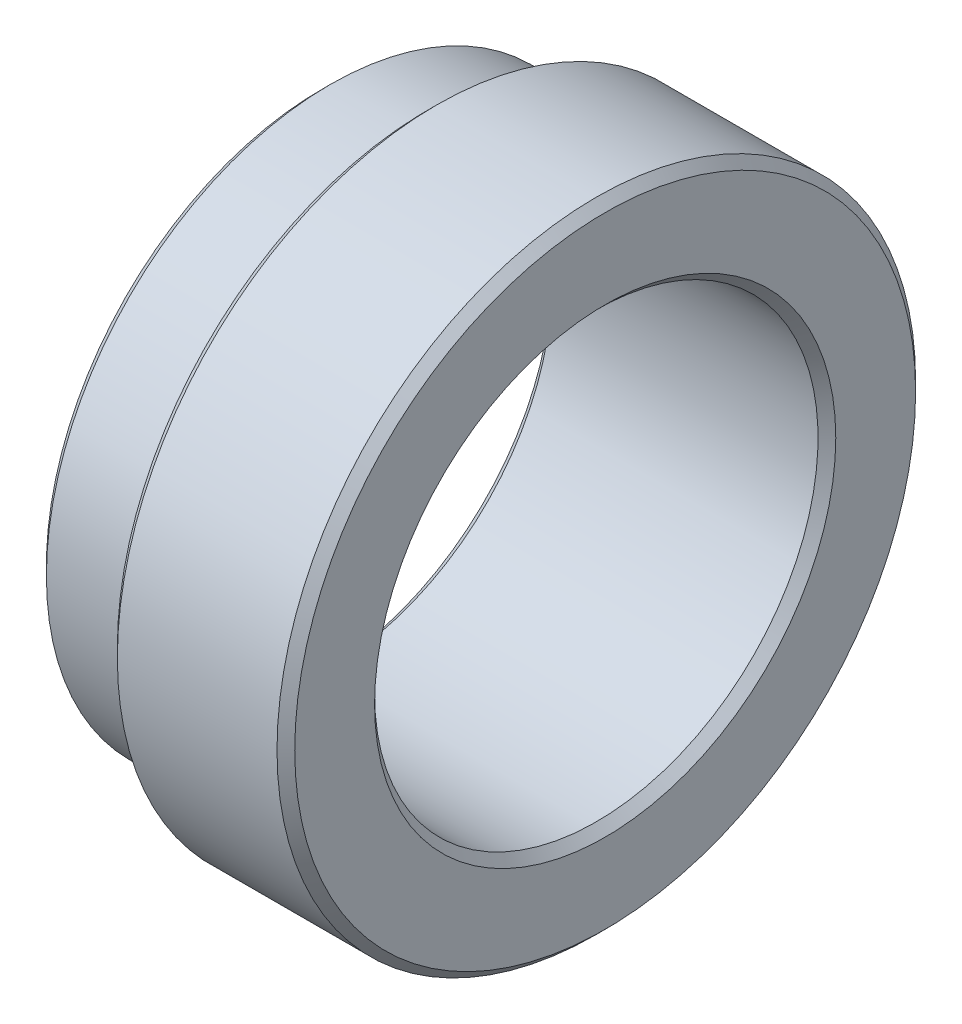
from build123d import *

# Parameters (mm, degrees)
CHANFREIN1_SIZE = 0.25


with BuildPart() as part:
    # Esquisse1 → R_volution1 (revolve)
    with BuildSketch(Plane(origin=(0, 0, 0), x_dir=(1, 0, 0), z_dir=(0, 1, 0)), mode=Mode.PRIVATE) as r_volution1_sk:
        Polygon((0, 6.25), (8, 6.25), (8, 9), (3, 9), (3, 8), (0, 8), align=None)
    revolve(r_volution1_sk.sketch.rotate(Axis((0, 0, 0), (1, 0, 0)), 180), axis=Axis((0, 0, 0), (1, 0, 0)))

    # Chanfrein1
    chanfrein1_edges = [part.edges().sort_by_distance(p)[0] for p in [
        (0, 0, -8),
        (3, 0, -9),
        (8, 0, -9),
        (8, 0, -6.25),
        (0, 0, -6.25),
    ]]
    chamfer(chanfrein1_edges, length=CHANFREIN1_SIZE)


solid = part.part
